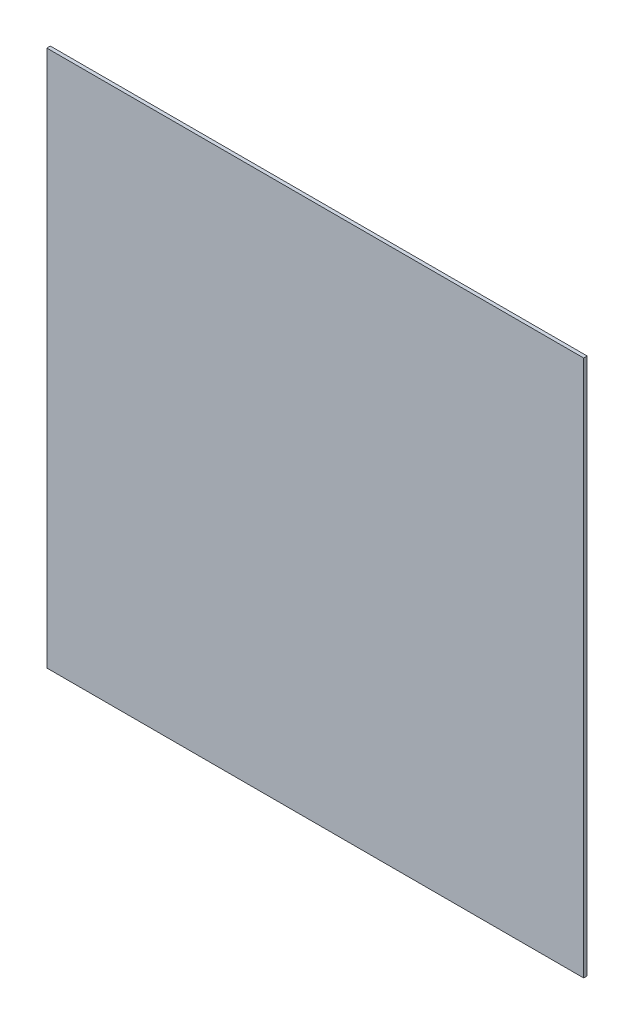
ISO-10303-21;
HEADER;
FILE_DESCRIPTION(('STEP AP214'),'2;1');
FILE_NAME('part.step','',(''),(''),'','','');
FILE_SCHEMA(('AUTOMOTIVE_DESIGN { 1 0 10303 214 1 1 1 1 }'));
ENDSEC;
DATA;
#1=APPLICATION_CONTEXT('core data for automotive mechanical design processes');
#2=APPLICATION_PROTOCOL_DEFINITION('international standard','automotive_design',2000,#1);
#3=PRODUCT_CONTEXT('',#1,'mechanical');
#4=PRODUCT('Part','Part','',(#3));
#5=PRODUCT_RELATED_PRODUCT_CATEGORY('part','',(#4));
#6=PRODUCT_DEFINITION_FORMATION('','',#4);
#7=PRODUCT_DEFINITION_CONTEXT('part definition',#1,'design');
#8=PRODUCT_DEFINITION('design','',#6,#7);
#9=PRODUCT_DEFINITION_SHAPE('','',#8);
#10=(LENGTH_UNIT() NAMED_UNIT(*) SI_UNIT(.MILLI.,.METRE.));
#11=(NAMED_UNIT(*) PLANE_ANGLE_UNIT() SI_UNIT($,.RADIAN.));
#12=(NAMED_UNIT(*) SI_UNIT($,.STERADIAN.) SOLID_ANGLE_UNIT());
#13=UNCERTAINTY_MEASURE_WITH_UNIT(LENGTH_MEASURE(1.E-05),#10,'distance_accuracy_value','');
#14=(GEOMETRIC_REPRESENTATION_CONTEXT(3) GLOBAL_UNCERTAINTY_ASSIGNED_CONTEXT((#13)) GLOBAL_UNIT_ASSIGNED_CONTEXT((#10,
#11,#12)) REPRESENTATION_CONTEXT('',''));
#15=CARTESIAN_POINT('',(0.,0.,0.));
#16=DIRECTION('',(0.,0.,1.));
#17=DIRECTION('',(1.,0.,0.));
#18=AXIS2_PLACEMENT_3D('',#15,#16,#17);
#19=CARTESIAN_POINT('',(0.,0.,10.));
#20=DIRECTION('',(1.,0.,0.));
#21=DIRECTION('',(0.,0.,-1.));
#22=AXIS2_PLACEMENT_3D('',#19,#20,#21);
#23=PLANE('',#22);
#24=DIRECTION('',(0.,-1.,0.));
#25=VECTOR('',#24,1.);
#26=CARTESIAN_POINT('',(0.,0.,0.));
#27=LINE('',#26,#25);
#28=CARTESIAN_POINT('',(0.,1524.,0.));
#29=VERTEX_POINT('',#28);
#30=CARTESIAN_POINT('',(0.,0.,0.));
#31=VERTEX_POINT('',#30);
#32=EDGE_CURVE('E96',#29,#31,#27,.T.);
#33=ORIENTED_EDGE('',*,*,#32,.T.);
#34=DIRECTION('',(0.,0.,-1.));
#35=VECTOR('',#34,1.);
#36=CARTESIAN_POINT('',(0.,0.,10.));
#37=LINE('',#36,#35);
#38=CARTESIAN_POINT('',(0.,0.,10.));
#39=VERTEX_POINT('',#38);
#40=EDGE_CURVE('E11',#39,#31,#37,.T.);
#41=ORIENTED_EDGE('',*,*,#40,.F.);
#42=DIRECTION('',(0.,-1.,0.));
#43=VECTOR('',#42,1.);
#44=CARTESIAN_POINT('',(0.,0.,10.));
#45=LINE('',#44,#43);
#46=CARTESIAN_POINT('',(0.,1524.,10.));
#47=VERTEX_POINT('',#46);
#48=EDGE_CURVE('E84',#47,#39,#45,.T.);
#49=ORIENTED_EDGE('',*,*,#48,.F.);
#50=DIRECTION('',(0.,0.,-1.));
#51=VECTOR('',#50,1.);
#52=CARTESIAN_POINT('',(0.,1524.,10.));
#53=LINE('',#52,#51);
#54=EDGE_CURVE('E92',#47,#29,#53,.T.);
#55=ORIENTED_EDGE('',*,*,#54,.T.);
#56=EDGE_LOOP('',(#33,#41,#49,#55));
#57=FACE_BOUND('',#56,.T.);
#58=ADVANCED_FACE('F33',(#57),#23,.F.);
#59=CARTESIAN_POINT('',(0.,0.,10.));
#60=DIRECTION('',(0.,1.,0.));
#61=DIRECTION('',(0.,0.,1.));
#62=AXIS2_PLACEMENT_3D('',#59,#60,#61);
#63=PLANE('',#62);
#64=DIRECTION('',(1.,0.,0.));
#65=VECTOR('',#64,1.);
#66=CARTESIAN_POINT('',(0.,0.,0.));
#67=LINE('',#66,#65);
#68=CARTESIAN_POINT('',(1524.,0.,0.));
#69=VERTEX_POINT('',#68);
#70=EDGE_CURVE('E88',#31,#69,#67,.T.);
#71=ORIENTED_EDGE('',*,*,#70,.T.);
#72=DIRECTION('',(0.,0.,-1.));
#73=VECTOR('',#72,1.);
#74=CARTESIAN_POINT('',(1524.,0.,10.));
#75=LINE('',#74,#73);
#76=CARTESIAN_POINT('',(1524.,0.,10.));
#77=VERTEX_POINT('',#76);
#78=EDGE_CURVE('E41',#77,#69,#75,.T.);
#79=ORIENTED_EDGE('',*,*,#78,.F.);
#80=DIRECTION('',(1.,0.,0.));
#81=VECTOR('',#80,1.);
#82=CARTESIAN_POINT('',(0.,0.,10.));
#83=LINE('',#82,#81);
#84=EDGE_CURVE('E79',#39,#77,#83,.T.);
#85=ORIENTED_EDGE('',*,*,#84,.F.);
#86=ORIENTED_EDGE('',*,*,#40,.T.);
#87=EDGE_LOOP('',(#71,#79,#85,#86));
#88=FACE_BOUND('',#87,.T.);
#89=ADVANCED_FACE('F87',(#88),#63,.F.);
#90=CARTESIAN_POINT('',(1524.,0.,10.));
#91=DIRECTION('',(-1.,0.,0.));
#92=DIRECTION('',(0.,0.,1.));
#93=AXIS2_PLACEMENT_3D('',#90,#91,#92);
#94=PLANE('',#93);
#95=DIRECTION('',(0.,1.,0.));
#96=VECTOR('',#95,1.);
#97=CARTESIAN_POINT('',(1524.,0.,0.));
#98=LINE('',#97,#96);
#99=CARTESIAN_POINT('',(1524.,1524.,0.));
#100=VERTEX_POINT('',#99);
#101=EDGE_CURVE('E66',#69,#100,#98,.T.);
#102=ORIENTED_EDGE('',*,*,#101,.T.);
#103=DIRECTION('',(0.,0.,-1.));
#104=VECTOR('',#103,1.);
#105=CARTESIAN_POINT('',(1524.,1524.,10.));
#106=LINE('',#105,#104);
#107=CARTESIAN_POINT('',(1524.,1524.,10.));
#108=VERTEX_POINT('',#107);
#109=EDGE_CURVE('E89',#108,#100,#106,.T.);
#110=ORIENTED_EDGE('',*,*,#109,.F.);
#111=DIRECTION('',(0.,1.,0.));
#112=VECTOR('',#111,1.);
#113=CARTESIAN_POINT('',(1524.,0.,10.));
#114=LINE('',#113,#112);
#115=EDGE_CURVE('E82',#77,#108,#114,.T.);
#116=ORIENTED_EDGE('',*,*,#115,.F.);
#117=ORIENTED_EDGE('',*,*,#78,.T.);
#118=EDGE_LOOP('',(#102,#110,#116,#117));
#119=FACE_BOUND('',#118,.T.);
#120=ADVANCED_FACE('F90',(#119),#94,.F.);
#121=CARTESIAN_POINT('',(0.,1524.,10.));
#122=DIRECTION('',(0.,-1.,0.));
#123=DIRECTION('',(0.,0.,-1.));
#124=AXIS2_PLACEMENT_3D('',#121,#122,#123);
#125=PLANE('',#124);
#126=DIRECTION('',(-1.,0.,0.));
#127=VECTOR('',#126,1.);
#128=CARTESIAN_POINT('',(0.,1524.,0.));
#129=LINE('',#128,#127);
#130=EDGE_CURVE('E72',#100,#29,#129,.T.);
#131=ORIENTED_EDGE('',*,*,#130,.T.);
#132=ORIENTED_EDGE('',*,*,#54,.F.);
#133=DIRECTION('',(-1.,0.,0.));
#134=VECTOR('',#133,1.);
#135=CARTESIAN_POINT('',(0.,1524.,10.));
#136=LINE('',#135,#134);
#137=EDGE_CURVE('E49',#108,#47,#136,.T.);
#138=ORIENTED_EDGE('',*,*,#137,.F.);
#139=ORIENTED_EDGE('',*,*,#109,.T.);
#140=EDGE_LOOP('',(#131,#132,#138,#139));
#141=FACE_BOUND('',#140,.T.);
#142=ADVANCED_FACE('F103',(#141),#125,.F.);
#143=CARTESIAN_POINT('',(0.,0.,10.));
#144=DIRECTION('',(0.,0.,-1.));
#145=DIRECTION('',(-1.,0.,0.));
#146=AXIS2_PLACEMENT_3D('',#143,#144,#145);
#147=PLANE('',#146);
#148=ORIENTED_EDGE('',*,*,#48,.T.);
#149=ORIENTED_EDGE('',*,*,#84,.T.);
#150=ORIENTED_EDGE('',*,*,#115,.T.);
#151=ORIENTED_EDGE('',*,*,#137,.T.);
#152=EDGE_LOOP('',(#148,#149,#150,#151));
#153=FACE_BOUND('',#152,.T.);
#154=ADVANCED_FACE('F80',(#153),#147,.F.);
#155=CARTESIAN_POINT('',(0.,0.,0.));
#156=DIRECTION('',(0.,0.,-1.));
#157=DIRECTION('',(-1.,0.,0.));
#158=AXIS2_PLACEMENT_3D('',#155,#156,#157);
#159=PLANE('',#158);
#160=ORIENTED_EDGE('',*,*,#32,.F.);
#161=ORIENTED_EDGE('',*,*,#130,.F.);
#162=ORIENTED_EDGE('',*,*,#101,.F.);
#163=ORIENTED_EDGE('',*,*,#70,.F.);
#164=EDGE_LOOP('',(#160,#161,#162,#163));
#165=FACE_BOUND('',#164,.T.);
#166=ADVANCED_FACE('F106',(#165),#159,.T.);
#167=CLOSED_SHELL('',(#58,#89,#120,#142,#154,#166));
#168=MANIFOLD_SOLID_BREP('B2',#167);
#169=ADVANCED_BREP_SHAPE_REPRESENTATION('',(#18,#168),#14);
#170=SHAPE_DEFINITION_REPRESENTATION(#9,#169);
ENDSEC;
END-ISO-10303-21;
